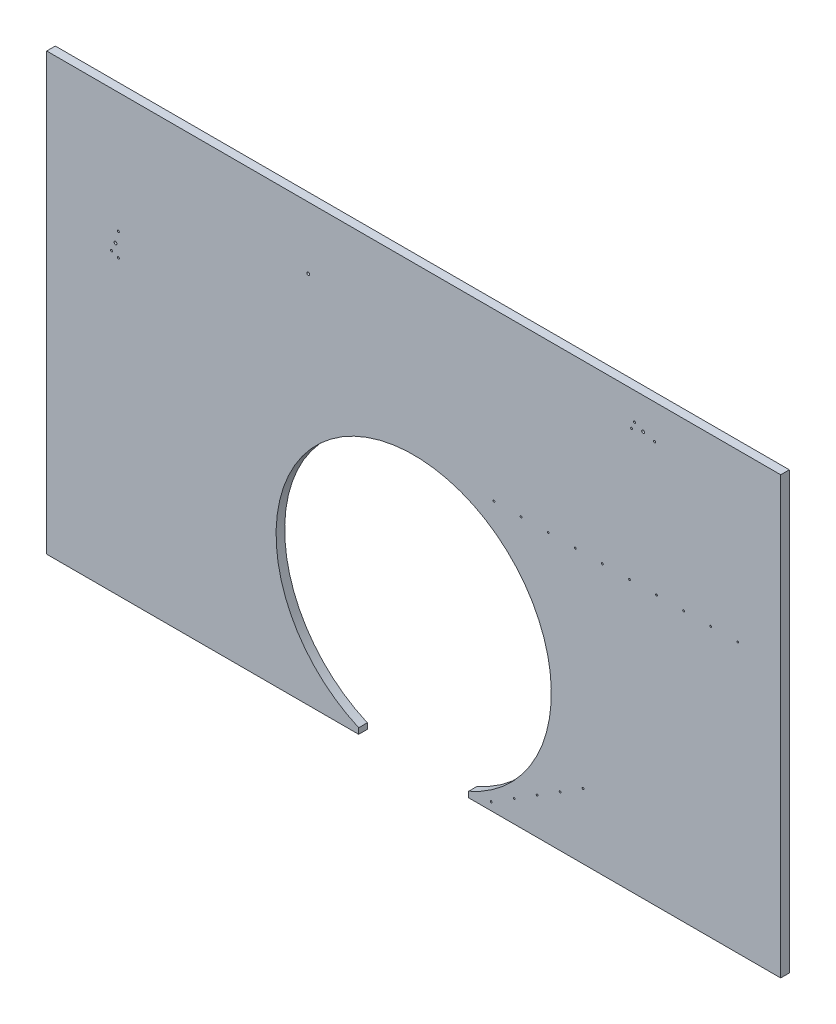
from build123d import *

# Parameters (mm, degrees)
SKETCH1_W           = 1625.6
SKETCH1_H           = 965.2
BOSS_EXTRUDE1_DEPTH = 19.05
CUT_EXTRUDE1_DEPTH  = 1253.303075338
SKETCH3_R           = 3.175
CUT_EXTRUDE2_DEPTH  = 12.7
SKETCH6_R           = 3.175
CUT_EXTRUDE5_DEPTH  = 12.7
SKETCH7_R           = 3.175
CUT_EXTRUDE6_DEPTH  = 12.7
SKETCH5_R           = 2
CUT_EXTRUDE7_DEPTH  = 1253.303075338
SKETCH4_R           = 2
CUT_EXTRUDE8_DEPTH  = 1253.303075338
SKETCH9_R           = 2.2479
CUT_EXTRUDE9_DEPTH  = 1253.303075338
SKETCH10_W          = 243.628241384
SKETCH10_H          = 12.7
CUT_EXTRUDE10_DEPTH = 1253.303075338


with BuildPart() as part:
    # Sketch1 → Boss-Extrude1 (new body)
    with BuildSketch(Plane.XY):
        with Locations((0, 469.9)):
            Rectangle(SKETCH1_W, SKETCH1_H)
    extrude(amount=BOSS_EXTRUDE1_DEPTH)

    # Sketch2 → Cut-Extrude1 (cut, through all)
    with BuildSketch(Plane.XY.offset(19.05)):
        with BuildLine():
            Line((-121.814120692, 0), (121.814120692, 0))
            ThreePointArc((121.814120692, 0), (0, 584.2), (-121.814120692, 0))
        make_face()
    extrude(amount=-CUT_EXTRUDE1_DEPTH, mode=Mode.SUBTRACT)

    # Sketch3 → Cut-Extrude2 (cut)
    with BuildSketch(Plane.XY.offset(19.05)):
        with Locations((508, 882.65)):
            Circle(SKETCH3_R)
    extrude(amount=-CUT_EXTRUDE2_DEPTH, mode=Mode.SUBTRACT)

    # Sketch6 → Cut-Extrude5 (cut)
    with BuildSketch(Plane.XY.offset(19.05)):
        with Locations((-233.47706466, 814.916666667)):
            Circle(SKETCH6_R)
    extrude(amount=-CUT_EXTRUDE5_DEPTH, mode=Mode.SUBTRACT)

    # Sketch7 → Cut-Extrude6 (cut)
    with BuildSketch(Plane.XY.offset(19.05)):
        with Locations((-660.4, 660.4)):
            Circle(SKETCH7_R)
    extrude(amount=-CUT_EXTRUDE6_DEPTH, mode=Mode.SUBTRACT)

    # Sketch5 → Cut-Extrude7 (cut, through all)
    with BuildSketch(Plane.XY.offset(19.05)):
        with Locations((177.8, 584.2)):
            Circle(SKETCH5_R)
        with Locations((237.8, 584.2)):
            Circle(SKETCH5_R)
        with Locations((297.8, 584.2)):
            Circle(SKETCH5_R)
        with Locations((357.8, 584.2)):
            Circle(SKETCH5_R)
        with Locations((417.8, 584.2)):
            Circle(SKETCH5_R)
        with Locations((477.8, 584.2)):
            Circle(SKETCH5_R)
        with Locations((537.8, 584.2)):
            Circle(SKETCH5_R)
        with Locations((597.8, 584.2)):
            Circle(SKETCH5_R)
        with Locations((657.8, 584.2)):
            Circle(SKETCH5_R)
        with Locations((717.8, 584.2)):
            Circle(SKETCH5_R)
    extrude(amount=-CUT_EXTRUDE7_DEPTH, mode=Mode.SUBTRACT)

    # Sketch4 → Cut-Extrude8 (cut, through all)
    with BuildSketch(Plane.XY.offset(19.05)):
        with Locations((171.614353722, 4.75962406)):
            Circle(SKETCH4_R)
        with Locations((222.497239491, 36.554779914)):
            Circle(SKETCH4_R)
        with Locations((273.380125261, 68.349935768)):
            Circle(SKETCH4_R)
        with Locations((324.26301103, 100.145091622)):
            Circle(SKETCH4_R)
        with Locations((375.145896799, 131.940247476)):
            Circle(SKETCH4_R)
    extrude(amount=-CUT_EXTRUDE8_DEPTH, mode=Mode.SUBTRACT)

    # Sketch9 → Cut-Extrude9 (cut, through all)
    with BuildSketch(Plane(origin=(0, 0, 0), x_dir=(-1, 0, 0), z_dir=(0, 0, -1))):
        with Locations((654.05, 685.8)):
            Circle(SKETCH9_R)
        with Locations((669.29, 641.35)):
            Circle(SKETCH9_R)
        with Locations((654.05, 635)):
            Circle(SKETCH9_R)
        with Locations((-488.95, 891.54)):
            Circle(SKETCH9_R)
        with Locations((-482.6, 876.3)):
            Circle(SKETCH9_R)
        with Locations((-533.4, 876.3)):
            Circle(SKETCH9_R)
    extrude(amount=-CUT_EXTRUDE9_DEPTH, mode=Mode.SUBTRACT)

    # Sketch10 → Cut-Extrude10 (cut, through all)
    with BuildSketch(Plane.XY.offset(19.05)):
        with Locations((0, -6.35)):
            Rectangle(SKETCH10_W, SKETCH10_H)
    extrude(amount=-CUT_EXTRUDE10_DEPTH, mode=Mode.SUBTRACT)


solid = part.part
